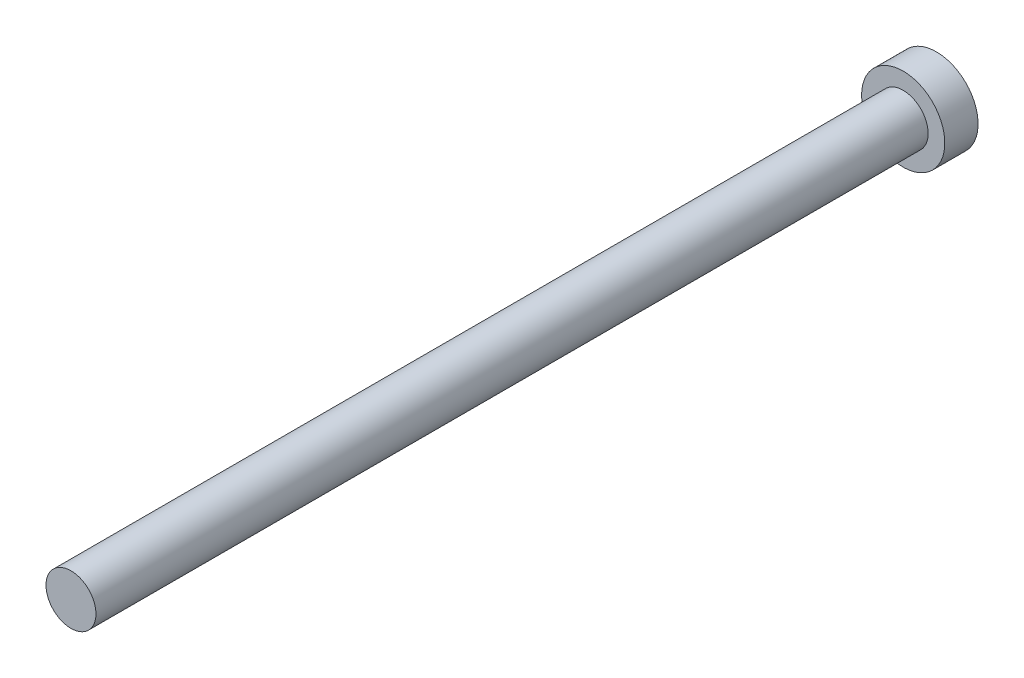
ISO-10303-21;
HEADER;
FILE_DESCRIPTION(('STEP AP214'),'2;1');
FILE_NAME('part.step','',(''),(''),'','','');
FILE_SCHEMA(('AUTOMOTIVE_DESIGN { 1 0 10303 214 1 1 1 1 }'));
ENDSEC;
DATA;
#1=APPLICATION_CONTEXT('core data for automotive mechanical design processes');
#2=APPLICATION_PROTOCOL_DEFINITION('international standard','automotive_design',2000,#1);
#3=PRODUCT_CONTEXT('',#1,'mechanical');
#4=PRODUCT('Part','Part','',(#3));
#5=PRODUCT_RELATED_PRODUCT_CATEGORY('part','',(#4));
#6=PRODUCT_DEFINITION_FORMATION('','',#4);
#7=PRODUCT_DEFINITION_CONTEXT('part definition',#1,'design');
#8=PRODUCT_DEFINITION('design','',#6,#7);
#9=PRODUCT_DEFINITION_SHAPE('','',#8);
#10=(LENGTH_UNIT() NAMED_UNIT(*) SI_UNIT(.MILLI.,.METRE.));
#11=(NAMED_UNIT(*) PLANE_ANGLE_UNIT() SI_UNIT($,.RADIAN.));
#12=(NAMED_UNIT(*) SI_UNIT($,.STERADIAN.) SOLID_ANGLE_UNIT());
#13=UNCERTAINTY_MEASURE_WITH_UNIT(LENGTH_MEASURE(1.E-05),#10,'distance_accuracy_value','');
#14=(GEOMETRIC_REPRESENTATION_CONTEXT(3) GLOBAL_UNCERTAINTY_ASSIGNED_CONTEXT((#13)) GLOBAL_UNIT_ASSIGNED_CONTEXT((#10,
#11,#12)) REPRESENTATION_CONTEXT('',''));
#15=CARTESIAN_POINT('',(0.,0.,0.));
#16=DIRECTION('',(0.,0.,1.));
#17=DIRECTION('',(1.,0.,0.));
#18=AXIS2_PLACEMENT_3D('',#15,#16,#17);
#19=CARTESIAN_POINT('',(0.,0.,50.));
#20=DIRECTION('',(0.,0.,-1.));
#21=DIRECTION('',(-1.,0.,0.));
#22=AXIS2_PLACEMENT_3D('',#19,#20,#21);
#23=CYLINDRICAL_SURFACE('',#22,1.5);
#24=CARTESIAN_POINT('',(0.,0.,50.));
#25=DIRECTION('',(0.,0.,1.));
#26=DIRECTION('',(1.,0.,0.));
#27=AXIS2_PLACEMENT_3D('',#24,#25,#26);
#28=CIRCLE('',#27,1.5);
#29=CARTESIAN_POINT('',(1.5,0.,50.));
#30=VERTEX_POINT('',#29);
#31=EDGE_CURVE('E10',#30,#30,#28,.T.);
#32=ORIENTED_EDGE('',*,*,#31,.F.);
#33=EDGE_LOOP('',(#32));
#34=FACE_BOUND('',#33,.T.);
#35=CARTESIAN_POINT('',(0.,0.,0.));
#36=DIRECTION('',(0.,0.,-1.));
#37=DIRECTION('',(-1.,0.,0.));
#38=AXIS2_PLACEMENT_3D('',#35,#36,#37);
#39=CIRCLE('',#38,1.5);
#40=CARTESIAN_POINT('',(-1.5,0.,0.));
#41=VERTEX_POINT('',#40);
#42=EDGE_CURVE('E35',#41,#41,#39,.T.);
#43=ORIENTED_EDGE('',*,*,#42,.F.);
#44=EDGE_LOOP('',(#43));
#45=FACE_BOUND('',#44,.T.);
#46=ADVANCED_FACE('F29',(#34,#45),#23,.T.);
#47=CARTESIAN_POINT('',(0.,0.,50.));
#48=DIRECTION('',(0.,0.,1.));
#49=DIRECTION('',(1.,0.,0.));
#50=AXIS2_PLACEMENT_3D('',#47,#48,#49);
#51=PLANE('',#50);
#52=ORIENTED_EDGE('',*,*,#31,.T.);
#53=EDGE_LOOP('',(#52));
#54=FACE_BOUND('',#53,.T.);
#55=ADVANCED_FACE('F53',(#54),#51,.T.);
#56=CARTESIAN_POINT('',(0.,0.,0.));
#57=DIRECTION('',(0.,0.,-1.));
#58=DIRECTION('',(-1.,0.,0.));
#59=AXIS2_PLACEMENT_3D('',#56,#57,#58);
#60=PLANE('',#59);
#61=CARTESIAN_POINT('',(0.,0.,0.));
#62=DIRECTION('',(0.,0.,-1.));
#63=DIRECTION('',(-1.,0.,0.));
#64=AXIS2_PLACEMENT_3D('',#61,#62,#63);
#65=CIRCLE('',#64,2.5);
#66=CARTESIAN_POINT('',(-2.5,0.,0.));
#67=VERTEX_POINT('',#66);
#68=EDGE_CURVE('E43',#67,#67,#65,.T.);
#69=ORIENTED_EDGE('',*,*,#68,.F.);
#70=EDGE_LOOP('',(#69));
#71=FACE_BOUND('',#70,.T.);
#72=ORIENTED_EDGE('',*,*,#42,.T.);
#73=EDGE_LOOP('',(#72));
#74=FACE_BOUND('',#73,.T.);
#75=ADVANCED_FACE('F51',(#71,#74),#60,.F.);
#76=CARTESIAN_POINT('',(0.,0.,-2.));
#77=DIRECTION('',(0.,0.,1.));
#78=DIRECTION('',(1.,0.,0.));
#79=AXIS2_PLACEMENT_3D('',#76,#77,#78);
#80=CYLINDRICAL_SURFACE('',#79,2.5);
#81=CARTESIAN_POINT('',(0.,0.,-2.));
#82=DIRECTION('',(0.,0.,-1.));
#83=DIRECTION('',(-1.,0.,0.));
#84=AXIS2_PLACEMENT_3D('',#81,#82,#83);
#85=CIRCLE('',#84,2.5);
#86=CARTESIAN_POINT('',(-2.5,0.,-2.));
#87=VERTEX_POINT('',#86);
#88=EDGE_CURVE('E39',#87,#87,#85,.T.);
#89=ORIENTED_EDGE('',*,*,#88,.F.);
#90=EDGE_LOOP('',(#89));
#91=FACE_BOUND('',#90,.T.);
#92=ORIENTED_EDGE('',*,*,#68,.T.);
#93=EDGE_LOOP('',(#92));
#94=FACE_BOUND('',#93,.T.);
#95=ADVANCED_FACE('F49',(#91,#94),#80,.T.);
#96=CARTESIAN_POINT('',(0.,0.,-2.));
#97=DIRECTION('',(0.,0.,-1.));
#98=DIRECTION('',(-1.,0.,0.));
#99=AXIS2_PLACEMENT_3D('',#96,#97,#98);
#100=PLANE('',#99);
#101=ORIENTED_EDGE('',*,*,#88,.T.);
#102=EDGE_LOOP('',(#101));
#103=FACE_BOUND('',#102,.T.);
#104=ADVANCED_FACE('F59',(#103),#100,.T.);
#105=CLOSED_SHELL('',(#46,#55,#75,#95,#104));
#106=MANIFOLD_SOLID_BREP('B2',#105);
#107=ADVANCED_BREP_SHAPE_REPRESENTATION('',(#18,#106),#14);
#108=SHAPE_DEFINITION_REPRESENTATION(#9,#107);
ENDSEC;
END-ISO-10303-21;
